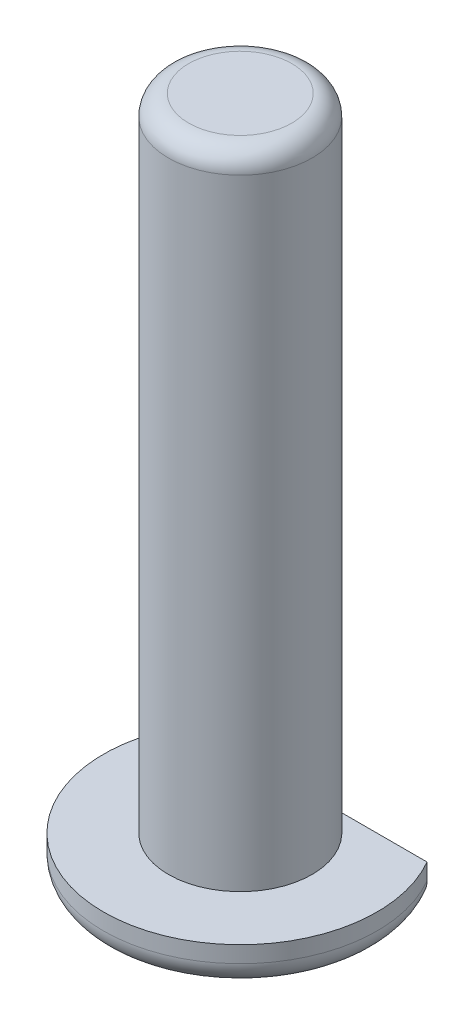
from build123d import *

# Parameters (mm, degrees)
SKETCH1_R               = 2.667
BOSS_EXTRUDE1_DEPTH     = 22.3012
SKETCH2_R               = 5.08
BOSS_EXTRUDE2_DEPTH     = 1.5
FILLET1_R               = 0.889
SKETCH3_R               = 2.667
BOSS_EXTRUDE3_DEPTH     = 1.5
FILLET2_R               = 0.75
CUT_EXTRUDE3_DEPTH      = 25.861816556
CUT_EXTRUDE3_DEPTH_BACK = 25.861816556


with BuildPart() as part:
    # Sketch1 → Boss-Extrude1 (new body)
    with BuildSketch(Plane(origin=(0, 0, 0), x_dir=(1, 0, 0), z_dir=(0, 1, 0))):
        with Locations(Location((0, 0, 0), (0, 0, 270))):
            Circle(SKETCH1_R)
    extrude(amount=BOSS_EXTRUDE1_DEPTH)

    # Sketch2 → Boss-Extrude2 (add)
    with BuildSketch(Plane.XZ):
        with Locations(Location((0, 0, 0), (0, 0, 270))):
            Circle(SKETCH2_R)
    extrude(amount=BOSS_EXTRUDE2_DEPTH)

    # Fillet1
    fillet1_edges = [part.edges().sort_by_distance(p)[0] for p in [
        (0, -1.5, 5.08),
    ]]
    fillet(fillet1_edges, radius=FILLET1_R)

    # Sketch3 → Boss-Extrude3 (add)
    with BuildSketch(Plane(origin=(0, 22.3012, 0), x_dir=(1, 0, 0), z_dir=(0, 1, 0))):
        with Locations(Location((0, 0, 0), (0, 0, 270))):
            Circle(SKETCH3_R)
    extrude(amount=BOSS_EXTRUDE3_DEPTH)

    # Fillet2
    fillet2_edges = [part.edges().sort_by_distance(p)[0] for p in [
        (0, 23.8012, -2.667),
    ]]
    fillet(fillet2_edges, radius=FILLET2_R)

    # Sketch4 → Cut-Extrude3 (cut, two sides: drawn at the far end of the back side and taken through both)
    with BuildSketch(Plane(origin=(0, 0, 0), x_dir=(1, 0, 0), z_dir=(0, 1, 0)).offset(-CUT_EXTRUDE3_DEPTH_BACK)):
        with BuildLine():
            Line((4.399409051, 2.54), (-4.399409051, 2.54))
            ThreePointArc((-4.399409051, 2.54), (0, 5.08), (4.399409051, 2.54))
        make_face()
    extrude(amount=CUT_EXTRUDE3_DEPTH + CUT_EXTRUDE3_DEPTH_BACK, mode=Mode.SUBTRACT)


solid = part.part
